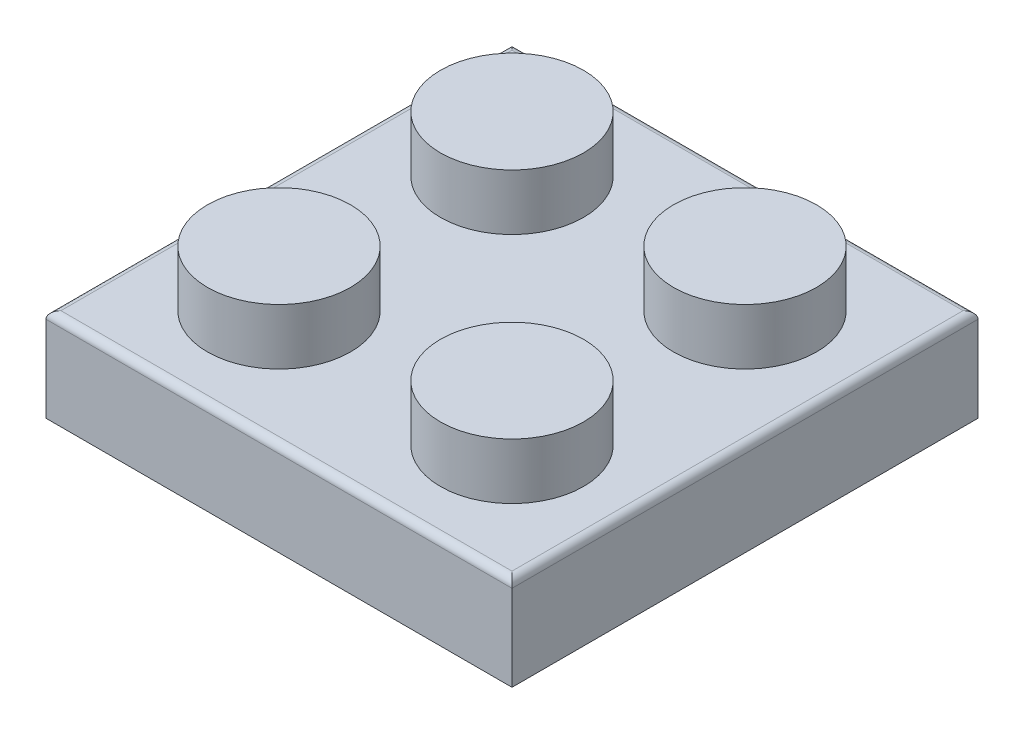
from build123d import *

# Parameters (mm, degrees)
SKETCH1_W            = 15.875
SKETCH1_H            = 15.875
BASE_EXTRUDE_DEPTH   = 3.175
SKETCH2_R            = 2.4384
BOSS_EXTRUDE1_DEPTH  = 1.905
LPATTERN4_COUNT      = 2
LPATTERN4_PITCH      = 7.9375
LPATTERN4_COUNT_DIR2 = 2
LPATTERN4_PITCH_DIR2 = 7.9375
SHELL1_T             = -1.5875
SKETCH3_R            = 3.2004
SKETCH3_R_2          = 2.4384
INSDOT_DEPTH         = 1.5875
FILLET1_R            = 0.254


with BuildPart() as part:
    # Sketch1 → Base-Extrude (new body)
    with BuildSketch(Plane(origin=(0, 0, 0), x_dir=(1, 0, 0), z_dir=(0, 1, 0))):
        Rectangle(SKETCH1_W, SKETCH1_H)
    extrude(amount=BASE_EXTRUDE_DEPTH)

    # Sketch2 → Boss-Extrude1 (add)
    with BuildSketch(Plane(origin=(0, 3.175, 0), x_dir=(-1, 0, 0), z_dir=(0, 1, 0))):
        with Locations(Location((3.96875, 3.96875, 0), (0, 0, 270))):
            Circle(SKETCH2_R)
    boss_extrude1 = extrude(amount=BOSS_EXTRUDE1_DEPTH)

    # LPattern4: Boss-Extrude1 2 × 2
    with Locations(*[(i * LPATTERN4_PITCH, 0, -j * LPATTERN4_PITCH_DIR2) for i in range(LPATTERN4_COUNT) for j in range(LPATTERN4_COUNT_DIR2) if (i, j) != (0, 0)]):
        add(boss_extrude1)

    # Shell1
    shell1_openings = [part.faces().sort_by_distance(p)[0] for p in [
        (0, 0, 0),
    ]]
    offset(amount=SHELL1_T, openings=shell1_openings, kind=Kind.INTERSECTION)

    # Sketch3 → InsDot (add)
    with BuildSketch(Plane.XZ.offset(-1.5875)):
        Circle(SKETCH3_R)
        Circle(SKETCH3_R_2, mode=Mode.SUBTRACT)
    extrude(amount=INSDOT_DEPTH)

    # Fillet1
    fillet1_edges = [part.edges().sort_by_distance(p)[0] for p in [
        (7.9375, 3.175, 0),
        (0, 3.175, -7.9375),
        (-7.9375, 3.175, 0),
        (0, 3.175, 7.9375),
    ]]
    fillet(fillet1_edges, radius=FILLET1_R)


solid = part.part
